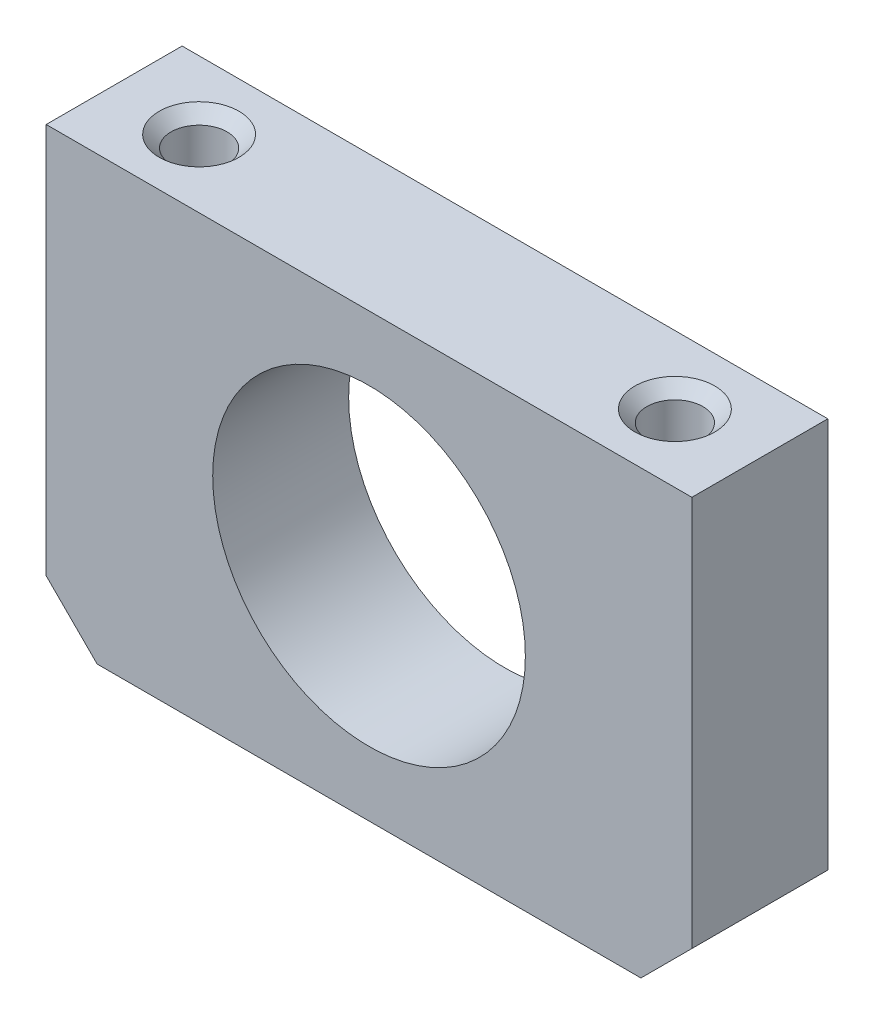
ISO-10303-21;
HEADER;
FILE_DESCRIPTION(('STEP AP214'),'2;1');
FILE_NAME('part.step','',(''),(''),'','','');
FILE_SCHEMA(('AUTOMOTIVE_DESIGN { 1 0 10303 214 1 1 1 1 }'));
ENDSEC;
DATA;
#1=APPLICATION_CONTEXT('core data for automotive mechanical design processes');
#2=APPLICATION_PROTOCOL_DEFINITION('international standard','automotive_design',2000,#1);
#3=PRODUCT_CONTEXT('',#1,'mechanical');
#4=PRODUCT('Part','Part','',(#3));
#5=PRODUCT_RELATED_PRODUCT_CATEGORY('part','',(#4));
#6=PRODUCT_DEFINITION_FORMATION('','',#4);
#7=PRODUCT_DEFINITION_CONTEXT('part definition',#1,'design');
#8=PRODUCT_DEFINITION('design','',#6,#7);
#9=PRODUCT_DEFINITION_SHAPE('','',#8);
#10=(LENGTH_UNIT() NAMED_UNIT(*) SI_UNIT(.MILLI.,.METRE.));
#11=(NAMED_UNIT(*) PLANE_ANGLE_UNIT() SI_UNIT($,.RADIAN.));
#12=(NAMED_UNIT(*) SI_UNIT($,.STERADIAN.) SOLID_ANGLE_UNIT());
#13=UNCERTAINTY_MEASURE_WITH_UNIT(LENGTH_MEASURE(1.E-05),#10,'distance_accuracy_value','');
#14=(GEOMETRIC_REPRESENTATION_CONTEXT(3) GLOBAL_UNCERTAINTY_ASSIGNED_CONTEXT((#13)) GLOBAL_UNIT_ASSIGNED_CONTEXT((#10,
#11,#12)) REPRESENTATION_CONTEXT('',''));
#15=CARTESIAN_POINT('',(0.,0.,0.));
#16=DIRECTION('',(0.,0.,1.));
#17=DIRECTION('',(1.,0.,0.));
#18=AXIS2_PLACEMENT_3D('',#15,#16,#17);
#19=CARTESIAN_POINT('',(-8.88178419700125E-13,1.66533453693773E-13,7.99999999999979));
#20=DIRECTION('',(0.999999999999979,0.,0.));
#21=DIRECTION('',(0.,0.,-0.999999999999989));
#22=AXIS2_PLACEMENT_3D('',#19,#20,#21);
#23=PLANE('',#22);
#24=DIRECTION('',(0.,-1.,0.));
#25=VECTOR('',#24,1.);
#26=CARTESIAN_POINT('',(0.,0.,0.));
#27=LINE('',#26,#25);
#28=CARTESIAN_POINT('',(-3.21964677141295E-12,26.0000000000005,1.11022302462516E-13));
#29=VERTEX_POINT('',#28);
#30=CARTESIAN_POINT('',(-5.10702591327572E-12,3.00000000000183,-2.22044604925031E-13));
#31=VERTEX_POINT('',#30);
#32=EDGE_CURVE('E120',#29,#31,#27,.T.);
#33=ORIENTED_EDGE('',*,*,#32,.T.);
#34=DIRECTION('',(0.,0.,0.999999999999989));
#35=VECTOR('',#34,1.);
#36=CARTESIAN_POINT('',(-8.10462807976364E-12,3.00000000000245,7.99999999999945));
#37=LINE('',#36,#35);
#38=CARTESIAN_POINT('',(-8.10462807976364E-12,3.00000000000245,7.99999999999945));
#39=VERTEX_POINT('',#38);
#40=EDGE_CURVE('E55',#31,#39,#37,.T.);
#41=ORIENTED_EDGE('',*,*,#40,.T.);
#42=DIRECTION('',(0.,-1.,0.));
#43=VECTOR('',#42,1.);
#44=CARTESIAN_POINT('',(-8.88178419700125E-13,1.66533453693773E-13,7.99999999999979));
#45=LINE('',#44,#43);
#46=CARTESIAN_POINT('',(-3.33066907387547E-12,26.0000000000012,8.00000000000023));
#47=VERTEX_POINT('',#46);
#48=EDGE_CURVE('E123',#47,#39,#45,.T.);
#49=ORIENTED_EDGE('',*,*,#48,.F.);
#50=DIRECTION('',(0.,0.,-0.999999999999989));
#51=VECTOR('',#50,1.);
#52=CARTESIAN_POINT('',(-3.33066907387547E-12,26.0000000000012,8.00000000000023));
#53=LINE('',#52,#51);
#54=EDGE_CURVE('E132',#47,#29,#53,.T.);
#55=ORIENTED_EDGE('',*,*,#54,.T.);
#56=EDGE_LOOP('',(#33,#41,#49,#55));
#57=FACE_BOUND('',#56,.T.);
#58=ADVANCED_FACE('F40',(#57),#23,.F.);
#59=CARTESIAN_POINT('',(-8.88178419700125E-13,1.66533453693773E-13,7.99999999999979));
#60=DIRECTION('',(0.,1.,0.));
#61=DIRECTION('',(0.,0.,0.999999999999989));
#62=AXIS2_PLACEMENT_3D('',#59,#60,#61);
#63=PLANE('',#62);
#64=DIRECTION('',(0.999999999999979,0.,0.));
#65=VECTOR('',#64,1.);
#66=CARTESIAN_POINT('',(0.,0.,0.));
#67=LINE('',#66,#65);
#68=CARTESIAN_POINT('',(2.99999999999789,2.22044604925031E-12,3.33066907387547E-13));
#69=VERTEX_POINT('',#68);
#70=CARTESIAN_POINT('',(34.9999999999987,1.11022302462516E-12,1.11022302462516E-13));
#71=VERTEX_POINT('',#70);
#72=EDGE_CURVE('E134',#69,#71,#67,.T.);
#73=ORIENTED_EDGE('',*,*,#72,.T.);
#74=DIRECTION('',(0.,0.,0.999999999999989));
#75=VECTOR('',#74,1.);
#76=CARTESIAN_POINT('',(34.9999999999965,2.83106871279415E-12,7.99999999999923));
#77=LINE('',#76,#75);
#78=CARTESIAN_POINT('',(34.9999999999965,2.83106871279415E-12,7.99999999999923));
#79=VERTEX_POINT('',#78);
#80=EDGE_CURVE('E63',#71,#79,#77,.T.);
#81=ORIENTED_EDGE('',*,*,#80,.T.);
#82=DIRECTION('',(0.999999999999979,0.,0.));
#83=VECTOR('',#82,1.);
#84=CARTESIAN_POINT('',(-8.88178419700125E-13,1.66533453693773E-13,7.99999999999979));
#85=LINE('',#84,#83);
#86=CARTESIAN_POINT('',(2.99999999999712,1.11022302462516E-12,7.99999999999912));
#87=VERTEX_POINT('',#86);
#88=EDGE_CURVE('E125',#87,#79,#85,.T.);
#89=ORIENTED_EDGE('',*,*,#88,.F.);
#90=DIRECTION('',(0.,0.,-0.999999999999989));
#91=VECTOR('',#90,1.);
#92=CARTESIAN_POINT('',(2.99999999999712,1.11022302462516E-12,7.99999999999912));
#93=LINE('',#92,#91);
#94=EDGE_CURVE('E151',#87,#69,#93,.T.);
#95=ORIENTED_EDGE('',*,*,#94,.T.);
#96=EDGE_LOOP('',(#73,#81,#89,#95));
#97=FACE_BOUND('',#96,.T.);
#98=ADVANCED_FACE('F181',(#97),#63,.F.);
#99=CARTESIAN_POINT('',(37.9999999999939,1.49880108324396E-12,8.00000000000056));
#100=DIRECTION('',(-0.999999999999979,0.,0.));
#101=DIRECTION('',(0.,0.,0.999999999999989));
#102=AXIS2_PLACEMENT_3D('',#99,#100,#101);
#103=PLANE('',#102);
#104=DIRECTION('',(0.,1.,0.));
#105=VECTOR('',#104,1.);
#106=CARTESIAN_POINT('',(37.9999999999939,1.49880108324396E-12,8.00000000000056));
#107=LINE('',#106,#105);
#108=CARTESIAN_POINT('',(37.9999999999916,3.00000000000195,7.9999999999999));
#109=VERTEX_POINT('',#108);
#110=CARTESIAN_POINT('',(37.9999999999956,26.000000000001,7.99999999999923));
#111=VERTEX_POINT('',#110);
#112=EDGE_CURVE('E128',#109,#111,#107,.T.);
#113=ORIENTED_EDGE('',*,*,#112,.F.);
#114=DIRECTION('',(0.,0.,-0.999999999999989));
#115=VECTOR('',#114,1.);
#116=CARTESIAN_POINT('',(37.9999999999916,3.00000000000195,7.9999999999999));
#117=LINE('',#116,#115);
#118=CARTESIAN_POINT('',(37.9999999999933,3.00000000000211,-3.33066907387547E-13));
#119=VERTEX_POINT('',#118);
#120=EDGE_CURVE('E144',#109,#119,#117,.T.);
#121=ORIENTED_EDGE('',*,*,#120,.T.);
#122=DIRECTION('',(0.,1.,0.));
#123=VECTOR('',#122,1.);
#124=CARTESIAN_POINT('',(37.9999999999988,8.88178419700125E-13,-3.33066907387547E-13));
#125=LINE('',#124,#123);
#126=CARTESIAN_POINT('',(37.9999999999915,26.0000000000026,-1.11022302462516E-13));
#127=VERTEX_POINT('',#126);
#128=EDGE_CURVE('E136',#119,#127,#125,.T.);
#129=ORIENTED_EDGE('',*,*,#128,.T.);
#130=DIRECTION('',(0.,0.,-0.999999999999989));
#131=VECTOR('',#130,1.);
#132=CARTESIAN_POINT('',(37.9999999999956,26.000000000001,7.99999999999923));
#133=LINE('',#132,#131);
#134=EDGE_CURVE('E141',#111,#127,#133,.T.);
#135=ORIENTED_EDGE('',*,*,#134,.F.);
#136=EDGE_LOOP('',(#113,#121,#129,#135));
#137=FACE_BOUND('',#136,.T.);
#138=ADVANCED_FACE('F186',(#137),#103,.F.);
#139=CARTESIAN_POINT('',(-3.33066907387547E-12,26.0000000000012,8.00000000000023));
#140=DIRECTION('',(0.,-1.,0.));
#141=DIRECTION('',(0.,0.,-0.999999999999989));
#142=AXIS2_PLACEMENT_3D('',#139,#140,#141);
#143=PLANE('',#142);
#144=CARTESIAN_POINT('',(32.999999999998,26.0000000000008,3.99999999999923));
#145=DIRECTION('',(0.,-1.,0.));
#146=DIRECTION('',(0.,0.,-0.999999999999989));
#147=AXIS2_PLACEMENT_3D('',#144,#145,#146);
#148=CIRCLE('',#147,2.35);
#149=CARTESIAN_POINT('',(32.9999999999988,26.0000000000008,6.35000000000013));
#150=VERTEX_POINT('',#149);
#151=EDGE_CURVE('E48',#150,#150,#148,.T.);
#152=ORIENTED_EDGE('',*,*,#151,.T.);
#153=EDGE_LOOP('',(#152));
#154=FACE_BOUND('',#153,.T.);
#155=CARTESIAN_POINT('',(4.99999999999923,26.0000000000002,4.00000000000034));
#156=DIRECTION('',(0.,-1.,0.));
#157=DIRECTION('',(0.,0.,-0.999999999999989));
#158=AXIS2_PLACEMENT_3D('',#155,#156,#157);
#159=CIRCLE('',#158,2.35);
#160=CARTESIAN_POINT('',(4.99999999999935,26.0000000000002,6.35000000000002));
#161=VERTEX_POINT('',#160);
#162=EDGE_CURVE('E163',#161,#161,#159,.T.);
#163=ORIENTED_EDGE('',*,*,#162,.T.);
#164=EDGE_LOOP('',(#163));
#165=FACE_BOUND('',#164,.T.);
#166=DIRECTION('',(-0.999999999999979,0.,0.));
#167=VECTOR('',#166,1.);
#168=CARTESIAN_POINT('',(-3.21964677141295E-12,26.0000000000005,1.11022302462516E-13));
#169=LINE('',#168,#167);
#170=EDGE_CURVE('E126',#127,#29,#169,.T.);
#171=ORIENTED_EDGE('',*,*,#170,.T.);
#172=ORIENTED_EDGE('',*,*,#54,.F.);
#173=DIRECTION('',(-0.999999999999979,0.,0.));
#174=VECTOR('',#173,1.);
#175=CARTESIAN_POINT('',(-3.33066907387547E-12,26.0000000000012,8.00000000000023));
#176=LINE('',#175,#174);
#177=EDGE_CURVE('E130',#111,#47,#176,.T.);
#178=ORIENTED_EDGE('',*,*,#177,.F.);
#179=ORIENTED_EDGE('',*,*,#134,.T.);
#180=EDGE_LOOP('',(#171,#172,#178,#179));
#181=FACE_BOUND('',#180,.T.);
#182=ADVANCED_FACE('F168',(#154,#165,#181),#143,.F.);
#183=CARTESIAN_POINT('',(-8.88178419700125E-13,1.66533453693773E-13,7.99999999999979));
#184=DIRECTION('',(0.,0.,-0.999999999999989));
#185=DIRECTION('',(-0.999999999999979,0.,0.));
#186=AXIS2_PLACEMENT_3D('',#183,#184,#185);
#187=PLANE('',#186);
#188=CARTESIAN_POINT('',(18.9999999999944,13.0000000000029,8.00000000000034));
#189=DIRECTION('',(0.,0.,-0.999999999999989));
#190=DIRECTION('',(-0.999999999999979,0.,0.));
#191=AXIS2_PLACEMENT_3D('',#188,#189,#190);
#192=CIRCLE('',#191,9.2);
#193=CARTESIAN_POINT('',(9.79999999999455,13.0000000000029,8.00000000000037));
#194=VERTEX_POINT('',#193);
#195=EDGE_CURVE('E117',#194,#194,#192,.T.);
#196=ORIENTED_EDGE('',*,*,#195,.T.);
#197=EDGE_LOOP('',(#196));
#198=FACE_BOUND('',#197,.T.);
#199=ORIENTED_EDGE('',*,*,#88,.T.);
#200=DIRECTION('',(-0.707106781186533,-0.707106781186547,0.));
#201=VECTOR('',#200,1.);
#202=CARTESIAN_POINT('',(37.9999999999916,3.00000000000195,7.9999999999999));
#203=LINE('',#202,#201);
#204=EDGE_CURVE('E157',#79,#109,#203,.F.);
#205=ORIENTED_EDGE('',*,*,#204,.T.);
#206=ORIENTED_EDGE('',*,*,#112,.T.);
#207=ORIENTED_EDGE('',*,*,#177,.T.);
#208=ORIENTED_EDGE('',*,*,#48,.T.);
#209=DIRECTION('',(-0.707106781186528,0.707106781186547,0.));
#210=VECTOR('',#209,1.);
#211=CARTESIAN_POINT('',(2.99999999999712,1.11022302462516E-12,7.99999999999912));
#212=LINE('',#211,#210);
#213=EDGE_CURVE('E155',#39,#87,#212,.F.);
#214=ORIENTED_EDGE('',*,*,#213,.T.);
#215=EDGE_LOOP('',(#199,#205,#206,#207,#208,#214));
#216=FACE_BOUND('',#215,.T.);
#217=ADVANCED_FACE('F207',(#198,#216),#187,.F.);
#218=CARTESIAN_POINT('',(0.,0.,0.));
#219=DIRECTION('',(0.,0.,-0.999999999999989));
#220=DIRECTION('',(-0.999999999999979,0.,0.));
#221=AXIS2_PLACEMENT_3D('',#218,#219,#220);
#222=PLANE('',#221);
#223=CARTESIAN_POINT('',(18.9999999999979,13.0000000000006,-5.55111512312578E-13));
#224=DIRECTION('',(0.,0.,-0.999999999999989));
#225=DIRECTION('',(-0.999999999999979,0.,0.));
#226=AXIS2_PLACEMENT_3D('',#223,#224,#225);
#227=CIRCLE('',#226,9.2);
#228=CARTESIAN_POINT('',(9.79999999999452,13.0000000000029,-5.22151766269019E-13));
#229=VERTEX_POINT('',#228);
#230=EDGE_CURVE('E114',#229,#229,#227,.T.);
#231=ORIENTED_EDGE('',*,*,#230,.F.);
#232=EDGE_LOOP('',(#231));
#233=FACE_BOUND('',#232,.T.);
#234=ORIENTED_EDGE('',*,*,#128,.F.);
#235=DIRECTION('',(0.707106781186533,0.707106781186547,0.));
#236=VECTOR('',#235,1.);
#237=CARTESIAN_POINT('',(17.4999999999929,-17.4999999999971,-3.33066907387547E-13));
#238=LINE('',#237,#236);
#239=EDGE_CURVE('E149',#119,#71,#238,.F.);
#240=ORIENTED_EDGE('',*,*,#239,.T.);
#241=ORIENTED_EDGE('',*,*,#72,.F.);
#242=DIRECTION('',(0.707106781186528,-0.707106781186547,0.));
#243=VECTOR('',#242,1.);
#244=CARTESIAN_POINT('',(1.49999999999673,1.500000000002,-2.22044604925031E-13));
#245=LINE('',#244,#243);
#246=EDGE_CURVE('E147',#69,#31,#245,.F.);
#247=ORIENTED_EDGE('',*,*,#246,.T.);
#248=ORIENTED_EDGE('',*,*,#32,.F.);
#249=ORIENTED_EDGE('',*,*,#170,.F.);
#250=EDGE_LOOP('',(#234,#240,#241,#247,#248,#249));
#251=FACE_BOUND('',#250,.T.);
#252=ADVANCED_FACE('F212',(#233,#251),#222,.T.);
#253=CARTESIAN_POINT('',(18.9999999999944,13.0000000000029,8.00000000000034));
#254=DIRECTION('',(0.,0.,-0.999999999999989));
#255=DIRECTION('',(-0.999999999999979,0.,0.));
#256=AXIS2_PLACEMENT_3D('',#253,#254,#255);
#257=CYLINDRICAL_SURFACE('',#256,9.2);
#258=CARTESIAN_POINT('',(9.79999999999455,13.0000000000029,8.00000000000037));
#259=CARTESIAN_POINT('',(9.79999999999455,13.0000000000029,7.91666666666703));
#260=CARTESIAN_POINT('',(9.79999999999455,13.0000000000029,7.83333333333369));
#261=CARTESIAN_POINT('',(9.79999999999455,13.0000000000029,7.666666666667));
#262=CARTESIAN_POINT('',(9.79999999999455,13.0000000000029,7.58333333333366));
#263=CARTESIAN_POINT('',(9.79999999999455,13.0000000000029,7.41666666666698));
#264=CARTESIAN_POINT('',(9.79999999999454,13.0000000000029,7.33333333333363));
#265=CARTESIAN_POINT('',(9.79999999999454,13.0000000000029,7.16666666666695));
#266=CARTESIAN_POINT('',(9.79999999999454,13.0000000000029,7.0833333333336));
#267=CARTESIAN_POINT('',(9.79999999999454,13.0000000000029,6.91666666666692));
#268=CARTESIAN_POINT('',(9.79999999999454,13.0000000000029,6.83333333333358));
#269=CARTESIAN_POINT('',(9.79999999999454,13.0000000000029,6.66666666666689));
#270=CARTESIAN_POINT('',(9.79999999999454,13.0000000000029,6.58333333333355));
#271=CARTESIAN_POINT('',(9.79999999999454,13.0000000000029,6.41666666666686));
#272=CARTESIAN_POINT('',(9.79999999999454,13.0000000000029,6.33333333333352));
#273=CARTESIAN_POINT('',(9.79999999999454,13.0000000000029,6.16666666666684));
#274=CARTESIAN_POINT('',(9.79999999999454,13.0000000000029,6.08333333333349));
#275=CARTESIAN_POINT('',(9.79999999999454,13.0000000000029,5.91666666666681));
#276=CARTESIAN_POINT('',(9.79999999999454,13.0000000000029,5.83333333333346));
#277=CARTESIAN_POINT('',(9.79999999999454,13.0000000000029,5.66666666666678));
#278=CARTESIAN_POINT('',(9.79999999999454,13.0000000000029,5.58333333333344));
#279=CARTESIAN_POINT('',(9.79999999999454,13.0000000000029,5.41666666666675));
#280=CARTESIAN_POINT('',(9.79999999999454,13.0000000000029,5.33333333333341));
#281=CARTESIAN_POINT('',(9.79999999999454,13.0000000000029,5.16666666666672));
#282=CARTESIAN_POINT('',(9.79999999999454,13.0000000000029,5.08333333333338));
#283=CARTESIAN_POINT('',(9.79999999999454,13.0000000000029,4.9166666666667));
#284=CARTESIAN_POINT('',(9.79999999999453,13.0000000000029,4.83333333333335));
#285=CARTESIAN_POINT('',(9.79999999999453,13.0000000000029,4.66666666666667));
#286=CARTESIAN_POINT('',(9.79999999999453,13.0000000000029,4.58333333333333));
#287=CARTESIAN_POINT('',(9.79999999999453,13.0000000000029,4.41666666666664));
#288=CARTESIAN_POINT('',(9.79999999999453,13.0000000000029,4.3333333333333));
#289=CARTESIAN_POINT('',(9.79999999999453,13.0000000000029,4.16666666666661));
#290=CARTESIAN_POINT('',(9.79999999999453,13.0000000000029,4.08333333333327));
#291=CARTESIAN_POINT('',(9.79999999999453,13.0000000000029,3.91666666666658));
#292=CARTESIAN_POINT('',(9.79999999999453,13.0000000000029,3.83333333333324));
#293=CARTESIAN_POINT('',(9.79999999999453,13.0000000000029,3.66666666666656));
#294=CARTESIAN_POINT('',(9.79999999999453,13.0000000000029,3.58333333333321));
#295=CARTESIAN_POINT('',(9.79999999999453,13.0000000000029,3.41666666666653));
#296=CARTESIAN_POINT('',(9.79999999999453,13.0000000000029,3.33333333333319));
#297=CARTESIAN_POINT('',(9.79999999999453,13.0000000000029,3.1666666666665));
#298=CARTESIAN_POINT('',(9.79999999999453,13.0000000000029,3.08333333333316));
#299=CARTESIAN_POINT('',(9.79999999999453,13.0000000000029,2.91666666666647));
#300=CARTESIAN_POINT('',(9.79999999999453,13.0000000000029,2.83333333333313));
#301=CARTESIAN_POINT('',(9.79999999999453,13.0000000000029,2.66666666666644));
#302=CARTESIAN_POINT('',(9.79999999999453,13.0000000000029,2.5833333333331));
#303=CARTESIAN_POINT('',(9.79999999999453,13.0000000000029,2.41666666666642));
#304=CARTESIAN_POINT('',(9.79999999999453,13.0000000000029,2.33333333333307));
#305=CARTESIAN_POINT('',(9.79999999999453,13.0000000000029,2.16666666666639));
#306=CARTESIAN_POINT('',(9.79999999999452,13.0000000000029,2.08333333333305));
#307=CARTESIAN_POINT('',(9.79999999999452,13.0000000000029,1.91666666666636));
#308=CARTESIAN_POINT('',(9.79999999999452,13.0000000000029,1.83333333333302));
#309=CARTESIAN_POINT('',(9.79999999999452,13.0000000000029,1.66666666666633));
#310=CARTESIAN_POINT('',(9.79999999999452,13.0000000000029,1.58333333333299));
#311=CARTESIAN_POINT('',(9.79999999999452,13.0000000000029,1.4166666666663));
#312=CARTESIAN_POINT('',(9.79999999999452,13.0000000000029,1.33333333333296));
#313=CARTESIAN_POINT('',(9.79999999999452,13.0000000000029,1.16666666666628));
#314=CARTESIAN_POINT('',(9.79999999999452,13.0000000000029,1.08333333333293));
#315=CARTESIAN_POINT('',(9.79999999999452,13.0000000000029,0.916666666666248));
#316=CARTESIAN_POINT('',(9.79999999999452,13.0000000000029,0.833333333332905));
#317=CARTESIAN_POINT('',(9.79999999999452,13.0000000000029,0.66666666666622));
#318=CARTESIAN_POINT('',(9.79999999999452,13.0000000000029,0.583333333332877));
#319=CARTESIAN_POINT('',(9.79999999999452,13.0000000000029,0.416666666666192));
#320=CARTESIAN_POINT('',(9.79999999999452,13.0000000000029,0.333333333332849));
#321=CARTESIAN_POINT('',(9.79999999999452,13.0000000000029,0.166666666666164));
#322=CARTESIAN_POINT('',(9.79999999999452,13.0000000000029,0.0833333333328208));
#323=CARTESIAN_POINT('',(9.79999999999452,13.0000000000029,-5.22151766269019E-13));
#324=B_SPLINE_CURVE_WITH_KNOTS('',3,(#258,#259,#260,#261,#262,#263,#264,#265,#266,#267,#268,
#269,#270,#271,#272,#273,#274,#275,#276,#277,#278,#279,#280,#281,#282,#283,#284,#285,#286,#287,
#288,#289,#290,#291,#292,#293,#294,#295,#296,#297,#298,#299,#300,#301,#302,#303,#304,#305,#306,
#307,#308,#309,#310,#311,#312,#313,#314,#315,#316,#317,#318,#319,#320,#321,#322,#323),
.UNSPECIFIED.,.F.,.F.,(4,2,2,2,2,2,2,2,2,2,2,2,2,2,2,2,2,2,2,2,2,2,2,2,2,2,2,2,2,2,2,2,4),(0.,
0.250000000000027,0.500000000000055,0.750000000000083,1.00000000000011,1.25000000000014,
1.50000000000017,1.75000000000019,2.00000000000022,2.25000000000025,2.50000000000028,
2.75000000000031,3.00000000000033,3.25000000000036,3.50000000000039,3.75000000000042,
4.00000000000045,4.25000000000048,4.5000000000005,4.75000000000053,5.00000000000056,
5.25000000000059,5.50000000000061,5.75000000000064,6.00000000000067,6.2500000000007,
6.50000000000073,6.75000000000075,7.00000000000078,7.25000000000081,7.50000000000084,
7.75000000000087,8.0000000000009),.UNSPECIFIED.);
#325=EDGE_CURVE('BSEAM194',#194,#229,#324,.T.);
#326=ORIENTED_EDGE('',*,*,#195,.F.);
#327=ORIENTED_EDGE('',*,*,#230,.T.);
#328=ORIENTED_EDGE('',*,*,#325,.T.);
#329=ORIENTED_EDGE('',*,*,#325,.F.);
#330=EDGE_LOOP('',(#326,#328,#327,#329));
#331=FACE_BOUND('',#330,.T.);
#332=ADVANCED_FACE('F194',(#331),#257,.F.);
#333=CARTESIAN_POINT('',(37.9999999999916,3.00000000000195,7.9999999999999));
#334=DIRECTION('',(-0.707106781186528,0.707106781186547,0.));
#335=DIRECTION('',(0.,0.,-0.999999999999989));
#336=AXIS2_PLACEMENT_3D('',#333,#334,#335);
#337=PLANE('',#336);
#338=ORIENTED_EDGE('',*,*,#204,.F.);
#339=ORIENTED_EDGE('',*,*,#80,.F.);
#340=ORIENTED_EDGE('',*,*,#239,.F.);
#341=ORIENTED_EDGE('',*,*,#120,.F.);
#342=EDGE_LOOP('',(#338,#339,#340,#341));
#343=FACE_BOUND('',#342,.T.);
#344=ADVANCED_FACE('F190',(#343),#337,.F.);
#345=CARTESIAN_POINT('',(2.99999999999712,1.11022302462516E-12,7.99999999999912));
#346=DIRECTION('',(0.707106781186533,0.707106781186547,0.));
#347=DIRECTION('',(0.,0.,-0.999999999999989));
#348=AXIS2_PLACEMENT_3D('',#345,#346,#347);
#349=PLANE('',#348);
#350=ORIENTED_EDGE('',*,*,#213,.F.);
#351=ORIENTED_EDGE('',*,*,#40,.F.);
#352=ORIENTED_EDGE('',*,*,#246,.F.);
#353=ORIENTED_EDGE('',*,*,#94,.F.);
#354=EDGE_LOOP('',(#350,#351,#352,#353));
#355=FACE_BOUND('',#354,.T.);
#356=ADVANCED_FACE('F193',(#355),#349,.F.);
#357=CARTESIAN_POINT('',(4.99999999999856,11.0000000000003,4.00000000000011));
#358=DIRECTION('',(0.,1.,0.));
#359=DIRECTION('',(0.,0.,0.999999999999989));
#360=AXIS2_PLACEMENT_3D('',#357,#358,#359);
#361=CONICAL_SURFACE('',#360,1.65,1.02974425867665);
#362=CARTESIAN_POINT('',(4.99999999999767,10.0085799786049,3.99999999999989));
#363=VERTEX_POINT('',#362);
#364=VERTEX_LOOP('',#363);
#365=FACE_BOUND('',#364,.T.);
#366=CARTESIAN_POINT('',(4.99999999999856,11.0000000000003,4.00000000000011));
#367=DIRECTION('',(0.,1.,0.));
#368=DIRECTION('',(0.,0.,0.999999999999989));
#369=AXIS2_PLACEMENT_3D('',#366,#367,#368);
#370=CIRCLE('',#369,1.65);
#371=CARTESIAN_POINT('',(4.99999999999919,11.0000000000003,5.65000000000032));
#372=VERTEX_POINT('',#371);
#373=EDGE_CURVE('E111',#372,#372,#370,.T.);
#374=ORIENTED_EDGE('',*,*,#373,.T.);
#375=EDGE_LOOP('',(#374));
#376=FACE_BOUND('',#375,.T.);
#377=ADVANCED_FACE('F197',(#365,#376),#361,.F.);
#378=CARTESIAN_POINT('',(4.99999999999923,26.0000000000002,4.00000000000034));
#379=DIRECTION('',(0.,1.,0.));
#380=DIRECTION('',(0.,0.,0.999999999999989));
#381=AXIS2_PLACEMENT_3D('',#378,#379,#380);
#382=CYLINDRICAL_SURFACE('',#381,1.64999999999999);
#383=CARTESIAN_POINT('',(4.99999999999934,25.3000000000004,4.00000000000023));
#384=DIRECTION('',(0.,-1.,0.));
#385=DIRECTION('',(0.,0.,-0.999999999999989));
#386=AXIS2_PLACEMENT_3D('',#383,#384,#385);
#387=CIRCLE('',#386,1.64999999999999);
#388=CARTESIAN_POINT('',(4.99999999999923,25.3000000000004,5.65000000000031));
#389=VERTEX_POINT('',#388);
#390=EDGE_CURVE('E11',#389,#389,#387,.F.);
#391=CARTESIAN_POINT('',(4.99999999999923,25.3000000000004,5.65000000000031));
#392=CARTESIAN_POINT('',(4.99999999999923,25.1510416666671,5.65000000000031));
#393=CARTESIAN_POINT('',(4.99999999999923,25.0020833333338,5.65000000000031));
#394=CARTESIAN_POINT('',(4.99999999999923,24.7041666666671,5.65000000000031));
#395=CARTESIAN_POINT('',(4.99999999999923,24.5552083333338,5.65000000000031));
#396=CARTESIAN_POINT('',(4.99999999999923,24.2572916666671,5.65000000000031));
#397=CARTESIAN_POINT('',(4.99999999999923,24.1083333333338,5.65000000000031));
#398=CARTESIAN_POINT('',(4.99999999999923,23.8104166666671,5.65000000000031));
#399=CARTESIAN_POINT('',(4.99999999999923,23.6614583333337,5.65000000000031));
#400=CARTESIAN_POINT('',(4.99999999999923,23.3635416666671,5.65000000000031));
#401=CARTESIAN_POINT('',(4.99999999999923,23.2145833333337,5.65000000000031));
#402=CARTESIAN_POINT('',(4.99999999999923,22.9166666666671,5.65000000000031));
#403=CARTESIAN_POINT('',(4.99999999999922,22.7677083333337,5.65000000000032));
#404=CARTESIAN_POINT('',(4.99999999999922,22.4697916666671,5.65000000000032));
#405=CARTESIAN_POINT('',(4.99999999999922,22.3208333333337,5.65000000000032));
#406=CARTESIAN_POINT('',(4.99999999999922,22.0229166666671,5.65000000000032));
#407=CARTESIAN_POINT('',(4.99999999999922,21.8739583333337,5.65000000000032));
#408=CARTESIAN_POINT('',(4.99999999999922,21.5760416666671,5.65000000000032));
#409=CARTESIAN_POINT('',(4.99999999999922,21.4270833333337,5.65000000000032));
#410=CARTESIAN_POINT('',(4.99999999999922,21.1291666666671,5.65000000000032));
#411=CARTESIAN_POINT('',(4.99999999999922,20.9802083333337,5.65000000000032));
#412=CARTESIAN_POINT('',(4.99999999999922,20.6822916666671,5.65000000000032));
#413=CARTESIAN_POINT('',(4.99999999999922,20.5333333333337,5.65000000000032));
#414=CARTESIAN_POINT('',(4.99999999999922,20.235416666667,5.65000000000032));
#415=CARTESIAN_POINT('',(4.99999999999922,20.0864583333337,5.65000000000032));
#416=CARTESIAN_POINT('',(4.99999999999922,19.788541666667,5.65000000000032));
#417=CARTESIAN_POINT('',(4.99999999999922,19.6395833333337,5.65000000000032));
#418=CARTESIAN_POINT('',(4.99999999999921,19.341666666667,5.65000000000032));
#419=CARTESIAN_POINT('',(4.99999999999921,19.1927083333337,5.65000000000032));
#420=CARTESIAN_POINT('',(4.99999999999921,18.894791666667,5.65000000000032));
#421=CARTESIAN_POINT('',(4.99999999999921,18.7458333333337,5.65000000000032));
#422=CARTESIAN_POINT('',(4.99999999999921,18.447916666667,5.65000000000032));
#423=CARTESIAN_POINT('',(4.99999999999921,18.2989583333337,5.65000000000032));
#424=CARTESIAN_POINT('',(4.99999999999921,18.001041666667,5.65000000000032));
#425=CARTESIAN_POINT('',(4.99999999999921,17.8520833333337,5.65000000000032));
#426=CARTESIAN_POINT('',(4.99999999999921,17.554166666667,5.65000000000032));
#427=CARTESIAN_POINT('',(4.99999999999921,17.4052083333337,5.65000000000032));
#428=CARTESIAN_POINT('',(4.99999999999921,17.107291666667,5.65000000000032));
#429=CARTESIAN_POINT('',(4.99999999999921,16.9583333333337,5.65000000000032));
#430=CARTESIAN_POINT('',(4.99999999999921,16.660416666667,5.65000000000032));
#431=CARTESIAN_POINT('',(4.99999999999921,16.5114583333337,5.65000000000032));
#432=CARTESIAN_POINT('',(4.99999999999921,16.213541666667,5.65000000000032));
#433=CARTESIAN_POINT('',(4.99999999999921,16.0645833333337,5.65000000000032));
#434=CARTESIAN_POINT('',(4.99999999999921,15.766666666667,5.65000000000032));
#435=CARTESIAN_POINT('',(4.99999999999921,15.6177083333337,5.65000000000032));
#436=CARTESIAN_POINT('',(4.99999999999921,15.319791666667,5.65000000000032));
#437=CARTESIAN_POINT('',(4.99999999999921,15.1708333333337,5.65000000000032));
#438=CARTESIAN_POINT('',(4.9999999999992,14.872916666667,5.65000000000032));
#439=CARTESIAN_POINT('',(4.9999999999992,14.7239583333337,5.65000000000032));
#440=CARTESIAN_POINT('',(4.9999999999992,14.426041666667,5.65000000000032));
#441=CARTESIAN_POINT('',(4.9999999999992,14.2770833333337,5.65000000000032));
#442=CARTESIAN_POINT('',(4.9999999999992,13.979166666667,5.65000000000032));
#443=CARTESIAN_POINT('',(4.9999999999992,13.8302083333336,5.65000000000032));
#444=CARTESIAN_POINT('',(4.9999999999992,13.532291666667,5.65000000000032));
#445=CARTESIAN_POINT('',(4.9999999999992,13.3833333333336,5.65000000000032));
#446=CARTESIAN_POINT('',(4.9999999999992,13.085416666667,5.65000000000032));
#447=CARTESIAN_POINT('',(4.9999999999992,12.9364583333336,5.65000000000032));
#448=CARTESIAN_POINT('',(4.9999999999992,12.638541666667,5.65000000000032));
#449=CARTESIAN_POINT('',(4.9999999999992,12.4895833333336,5.65000000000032));
#450=CARTESIAN_POINT('',(4.9999999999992,12.191666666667,5.65000000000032));
#451=CARTESIAN_POINT('',(4.9999999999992,12.0427083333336,5.65000000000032));
#452=CARTESIAN_POINT('',(4.9999999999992,11.744791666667,5.65000000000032));
#453=CARTESIAN_POINT('',(4.99999999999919,11.5958333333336,5.65000000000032));
#454=CARTESIAN_POINT('',(4.99999999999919,11.297916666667,5.65000000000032));
#455=CARTESIAN_POINT('',(4.99999999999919,11.1489583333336,5.65000000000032));
#456=CARTESIAN_POINT('',(4.99999999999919,11.0000000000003,5.65000000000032));
#457=B_SPLINE_CURVE_WITH_KNOTS('',3,(#391,#392,#393,#394,#395,#396,#397,#398,#399,#400,#401,
#402,#403,#404,#405,#406,#407,#408,#409,#410,#411,#412,#413,#414,#415,#416,#417,#418,#419,#420,
#421,#422,#423,#424,#425,#426,#427,#428,#429,#430,#431,#432,#433,#434,#435,#436,#437,#438,#439,
#440,#441,#442,#443,#444,#445,#446,#447,#448,#449,#450,#451,#452,#453,#454,#455,#456),
.UNSPECIFIED.,.F.,.F.,(4,2,2,2,2,2,2,2,2,2,2,2,2,2,2,2,2,2,2,2,2,2,2,2,2,2,2,2,2,2,2,2,4),(0.,
0.446875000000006,0.893750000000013,1.34062500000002,1.78750000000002,2.23437500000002,
2.68125000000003,3.12812500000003,3.57500000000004,4.02187500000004,4.46875000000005,
4.91562500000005,5.36250000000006,5.80937500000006,6.25625000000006,6.70312500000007,
7.15000000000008,7.59687500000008,8.04375000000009,8.49062500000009,8.93750000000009,
9.3843750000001,9.8312500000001,10.2781250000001,10.7250000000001,11.1718750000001,
11.6187500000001,12.0656250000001,12.5125000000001,12.9593750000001,13.4062500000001,
13.8531250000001,14.3000000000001),.UNSPECIFIED.);
#458=EDGE_CURVE('BSEAM105',#389,#372,#457,.T.);
#459=ORIENTED_EDGE('',*,*,#390,.T.);
#460=ORIENTED_EDGE('',*,*,#373,.F.);
#461=ORIENTED_EDGE('',*,*,#458,.T.);
#462=ORIENTED_EDGE('',*,*,#458,.F.);
#463=EDGE_LOOP('',(#459,#461,#460,#462));
#464=FACE_BOUND('',#463,.T.);
#465=ADVANCED_FACE('F105',(#464),#382,.F.);
#466=CARTESIAN_POINT('',(32.9999999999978,11.0000000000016,4.00000000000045));
#467=DIRECTION('',(0.,1.,0.));
#468=DIRECTION('',(0.,0.,0.999999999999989));
#469=AXIS2_PLACEMENT_3D('',#466,#467,#468);
#470=CONICAL_SURFACE('',#469,1.65,1.02974425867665);
#471=CARTESIAN_POINT('',(32.9999999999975,10.0085799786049,4.00000000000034));
#472=VERTEX_POINT('',#471);
#473=VERTEX_LOOP('',#472);
#474=FACE_BOUND('',#473,.T.);
#475=CARTESIAN_POINT('',(32.9999999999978,11.0000000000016,4.00000000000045));
#476=DIRECTION('',(0.,1.,0.));
#477=DIRECTION('',(0.,0.,0.999999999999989));
#478=AXIS2_PLACEMENT_3D('',#475,#476,#477);
#479=CIRCLE('',#478,1.65);
#480=CARTESIAN_POINT('',(32.999999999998,11.0000000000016,5.64999999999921));
#481=VERTEX_POINT('',#480);
#482=EDGE_CURVE('E109',#481,#481,#479,.T.);
#483=ORIENTED_EDGE('',*,*,#482,.T.);
#484=EDGE_LOOP('',(#483));
#485=FACE_BOUND('',#484,.T.);
#486=ADVANCED_FACE('F101',(#474,#485),#470,.F.);
#487=CARTESIAN_POINT('',(32.999999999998,26.0000000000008,3.99999999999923));
#488=DIRECTION('',(0.,1.,0.));
#489=DIRECTION('',(0.,0.,0.999999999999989));
#490=AXIS2_PLACEMENT_3D('',#487,#488,#489);
#491=CYLINDRICAL_SURFACE('',#490,1.65);
#492=CARTESIAN_POINT('',(32.9999999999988,25.3000000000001,3.99999999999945));
#493=DIRECTION('',(0.,-1.,0.));
#494=DIRECTION('',(0.,0.,-0.999999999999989));
#495=AXIS2_PLACEMENT_3D('',#492,#493,#494);
#496=CIRCLE('',#495,1.65);
#497=CARTESIAN_POINT('',(32.999999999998,25.3000000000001,5.64999999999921));
#498=VERTEX_POINT('',#497);
#499=EDGE_CURVE('E160',#498,#498,#496,.F.);
#500=CARTESIAN_POINT('',(32.999999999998,25.3000000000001,5.64999999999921));
#501=CARTESIAN_POINT('',(32.999999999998,25.1510416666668,5.64999999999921));
#502=CARTESIAN_POINT('',(32.999999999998,25.0020833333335,5.64999999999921));
#503=CARTESIAN_POINT('',(32.999999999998,24.7041666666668,5.64999999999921));
#504=CARTESIAN_POINT('',(32.999999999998,24.5552083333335,5.64999999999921));
#505=CARTESIAN_POINT('',(32.999999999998,24.2572916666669,5.64999999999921));
#506=CARTESIAN_POINT('',(32.999999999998,24.1083333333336,5.64999999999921));
#507=CARTESIAN_POINT('',(32.999999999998,23.8104166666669,5.64999999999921));
#508=CARTESIAN_POINT('',(32.999999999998,23.6614583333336,5.64999999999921));
#509=CARTESIAN_POINT('',(32.999999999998,23.363541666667,5.64999999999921));
#510=CARTESIAN_POINT('',(32.999999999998,23.2145833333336,5.64999999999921));
#511=CARTESIAN_POINT('',(32.999999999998,22.916666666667,5.64999999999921));
#512=CARTESIAN_POINT('',(32.999999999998,22.7677083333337,5.64999999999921));
#513=CARTESIAN_POINT('',(32.999999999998,22.4697916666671,5.64999999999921));
#514=CARTESIAN_POINT('',(32.999999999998,22.3208333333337,5.64999999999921));
#515=CARTESIAN_POINT('',(32.999999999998,22.0229166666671,5.64999999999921));
#516=CARTESIAN_POINT('',(32.999999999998,21.8739583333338,5.64999999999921));
#517=CARTESIAN_POINT('',(32.999999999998,21.5760416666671,5.64999999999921));
#518=CARTESIAN_POINT('',(32.999999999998,21.4270833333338,5.64999999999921));
#519=CARTESIAN_POINT('',(32.999999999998,21.1291666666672,5.64999999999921));
#520=CARTESIAN_POINT('',(32.999999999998,20.9802083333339,5.64999999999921));
#521=CARTESIAN_POINT('',(32.999999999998,20.6822916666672,5.64999999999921));
#522=CARTESIAN_POINT('',(32.999999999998,20.5333333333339,5.64999999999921));
#523=CARTESIAN_POINT('',(32.999999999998,20.2354166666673,5.64999999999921));
#524=CARTESIAN_POINT('',(32.999999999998,20.086458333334,5.64999999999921));
#525=CARTESIAN_POINT('',(32.999999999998,19.7885416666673,5.64999999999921));
#526=CARTESIAN_POINT('',(32.999999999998,19.639583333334,5.64999999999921));
#527=CARTESIAN_POINT('',(32.999999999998,19.3416666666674,5.64999999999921));
#528=CARTESIAN_POINT('',(32.999999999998,19.1927083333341,5.64999999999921));
#529=CARTESIAN_POINT('',(32.999999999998,18.8947916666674,5.64999999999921));
#530=CARTESIAN_POINT('',(32.999999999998,18.7458333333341,5.64999999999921));
#531=CARTESIAN_POINT('',(32.999999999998,18.4479166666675,5.64999999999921));
#532=CARTESIAN_POINT('',(32.999999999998,18.2989583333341,5.64999999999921));
#533=CARTESIAN_POINT('',(32.999999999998,18.0010416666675,5.64999999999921));
#534=CARTESIAN_POINT('',(32.999999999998,17.8520833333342,5.64999999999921));
#535=CARTESIAN_POINT('',(32.999999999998,17.5541666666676,5.64999999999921));
#536=CARTESIAN_POINT('',(32.999999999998,17.4052083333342,5.64999999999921));
#537=CARTESIAN_POINT('',(32.999999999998,17.1072916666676,5.64999999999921));
#538=CARTESIAN_POINT('',(32.999999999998,16.9583333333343,5.64999999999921));
#539=CARTESIAN_POINT('',(32.999999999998,16.6604166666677,5.64999999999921));
#540=CARTESIAN_POINT('',(32.999999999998,16.5114583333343,5.64999999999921));
#541=CARTESIAN_POINT('',(32.999999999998,16.2135416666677,5.64999999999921));
#542=CARTESIAN_POINT('',(32.999999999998,16.0645833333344,5.64999999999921));
#543=CARTESIAN_POINT('',(32.999999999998,15.7666666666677,5.64999999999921));
#544=CARTESIAN_POINT('',(32.999999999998,15.6177083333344,5.64999999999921));
#545=CARTESIAN_POINT('',(32.999999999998,15.3197916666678,5.64999999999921));
#546=CARTESIAN_POINT('',(32.999999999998,15.1708333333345,5.64999999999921));
#547=CARTESIAN_POINT('',(32.999999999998,14.8729166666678,5.64999999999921));
#548=CARTESIAN_POINT('',(32.999999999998,14.7239583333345,5.64999999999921));
#549=CARTESIAN_POINT('',(32.999999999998,14.4260416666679,5.64999999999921));
#550=CARTESIAN_POINT('',(32.999999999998,14.2770833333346,5.64999999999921));
#551=CARTESIAN_POINT('',(32.999999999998,13.9791666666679,5.64999999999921));
#552=CARTESIAN_POINT('',(32.999999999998,13.8302083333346,5.64999999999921));
#553=CARTESIAN_POINT('',(32.999999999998,13.532291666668,5.64999999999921));
#554=CARTESIAN_POINT('',(32.999999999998,13.3833333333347,5.64999999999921));
#555=CARTESIAN_POINT('',(32.999999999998,13.085416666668,5.64999999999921));
#556=CARTESIAN_POINT('',(32.999999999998,12.9364583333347,5.64999999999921));
#557=CARTESIAN_POINT('',(32.999999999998,12.6385416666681,5.64999999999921));
#558=CARTESIAN_POINT('',(32.999999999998,12.4895833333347,5.64999999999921));
#559=CARTESIAN_POINT('',(32.999999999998,12.1916666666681,5.64999999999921));
#560=CARTESIAN_POINT('',(32.999999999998,12.0427083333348,5.64999999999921));
#561=CARTESIAN_POINT('',(32.999999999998,11.7447916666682,5.64999999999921));
#562=CARTESIAN_POINT('',(32.999999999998,11.5958333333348,5.64999999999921));
#563=CARTESIAN_POINT('',(32.999999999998,11.2979166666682,5.64999999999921));
#564=CARTESIAN_POINT('',(32.999999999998,11.1489583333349,5.64999999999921));
#565=CARTESIAN_POINT('',(32.999999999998,11.0000000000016,5.64999999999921));
#566=B_SPLINE_CURVE_WITH_KNOTS('',3,(#500,#501,#502,#503,#504,#505,#506,#507,#508,#509,#510,
#511,#512,#513,#514,#515,#516,#517,#518,#519,#520,#521,#522,#523,#524,#525,#526,#527,#528,#529,
#530,#531,#532,#533,#534,#535,#536,#537,#538,#539,#540,#541,#542,#543,#544,#545,#546,#547,#548,
#549,#550,#551,#552,#553,#554,#555,#556,#557,#558,#559,#560,#561,#562,#563,#564,#565),
.UNSPECIFIED.,.F.,.F.,(4,2,2,2,2,2,2,2,2,2,2,2,2,2,2,2,2,2,2,2,2,2,2,2,2,2,2,2,2,2,2,2,4),(0.,
0.446874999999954,0.893749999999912,1.34062499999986,1.78749999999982,2.23437499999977,
2.68124999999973,3.12812499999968,3.57499999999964,4.02187499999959,4.46874999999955,
4.9156249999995,5.36249999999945,5.80937499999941,6.25624999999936,6.70312499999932,
7.14999999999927,7.59687499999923,8.04374999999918,8.49062499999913,8.93749999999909,
9.38437499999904,9.831249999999,10.278124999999,10.7249999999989,11.1718749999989,
11.6187499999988,12.0656249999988,12.5124999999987,12.9593749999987,13.4062499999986,
13.8531249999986,14.2999999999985),.UNSPECIFIED.);
#567=EDGE_CURVE('BSEAM104',#498,#481,#566,.T.);
#568=ORIENTED_EDGE('',*,*,#499,.T.);
#569=ORIENTED_EDGE('',*,*,#482,.F.);
#570=ORIENTED_EDGE('',*,*,#567,.T.);
#571=ORIENTED_EDGE('',*,*,#567,.F.);
#572=EDGE_LOOP('',(#568,#570,#569,#571));
#573=FACE_BOUND('',#572,.T.);
#574=ADVANCED_FACE('F104',(#573),#491,.F.);
#575=CARTESIAN_POINT('',(32.9999999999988,25.3000000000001,3.99999999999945));
#576=DIRECTION('',(0.,1.,0.));
#577=DIRECTION('',(0.,0.,0.999999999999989));
#578=AXIS2_PLACEMENT_3D('',#575,#576,#577);
#579=CONICAL_SURFACE('',#578,1.65,0.785398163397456);
#580=CARTESIAN_POINT('',(32.9999999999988,26.0000000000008,6.35000000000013));
#581=CARTESIAN_POINT('',(32.9999999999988,25.9927083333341,6.34270833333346));
#582=CARTESIAN_POINT('',(32.9999999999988,25.9854166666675,6.33541666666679));
#583=CARTESIAN_POINT('',(32.9999999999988,25.9708333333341,6.32083333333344));
#584=CARTESIAN_POINT('',(32.9999999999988,25.9635416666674,6.31354166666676));
#585=CARTESIAN_POINT('',(32.9999999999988,25.9489583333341,6.29895833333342));
#586=CARTESIAN_POINT('',(32.9999999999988,25.9416666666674,6.29166666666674));
#587=CARTESIAN_POINT('',(32.9999999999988,25.9270833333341,6.27708333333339));
#588=CARTESIAN_POINT('',(32.9999999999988,25.9197916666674,6.26979166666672));
#589=CARTESIAN_POINT('',(32.9999999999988,25.905208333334,6.25520833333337));
#590=CARTESIAN_POINT('',(32.9999999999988,25.8979166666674,6.2479166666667));
#591=CARTESIAN_POINT('',(32.9999999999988,25.883333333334,6.23333333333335));
#592=CARTESIAN_POINT('',(32.9999999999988,25.8760416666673,6.22604166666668));
#593=CARTESIAN_POINT('',(32.9999999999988,25.861458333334,6.21145833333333));
#594=CARTESIAN_POINT('',(32.9999999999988,25.8541666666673,6.20416666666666));
#595=CARTESIAN_POINT('',(32.9999999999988,25.839583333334,6.18958333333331));
#596=CARTESIAN_POINT('',(32.9999999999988,25.8322916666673,6.18229166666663));
#597=CARTESIAN_POINT('',(32.9999999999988,25.817708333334,6.16770833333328));
#598=CARTESIAN_POINT('',(32.9999999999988,25.8104166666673,6.16041666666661));
#599=CARTESIAN_POINT('',(32.9999999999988,25.7958333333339,6.14583333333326));
#600=CARTESIAN_POINT('',(32.9999999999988,25.7885416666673,6.13854166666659));
#601=CARTESIAN_POINT('',(32.9999999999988,25.7739583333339,6.12395833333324));
#602=CARTESIAN_POINT('',(32.9999999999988,25.7666666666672,6.11666666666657));
#603=CARTESIAN_POINT('',(32.9999999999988,25.7520833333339,6.10208333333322));
#604=CARTESIAN_POINT('',(32.9999999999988,25.7447916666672,6.09479166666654));
#605=CARTESIAN_POINT('',(32.9999999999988,25.7302083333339,6.0802083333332));
#606=CARTESIAN_POINT('',(32.9999999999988,25.7229166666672,6.07291666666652));
#607=CARTESIAN_POINT('',(32.9999999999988,25.7083333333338,6.05833333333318));
#608=CARTESIAN_POINT('',(32.9999999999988,25.7010416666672,6.0510416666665));
#609=CARTESIAN_POINT('',(32.9999999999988,25.6864583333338,6.03645833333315));
#610=CARTESIAN_POINT('',(32.9999999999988,25.6791666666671,6.02916666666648));
#611=CARTESIAN_POINT('',(32.9999999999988,25.6645833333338,6.01458333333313));
#612=CARTESIAN_POINT('',(32.9999999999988,25.6572916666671,6.00729166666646));
#613=CARTESIAN_POINT('',(32.9999999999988,25.6427083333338,5.99270833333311));
#614=CARTESIAN_POINT('',(32.9999999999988,25.6354166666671,5.98541666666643));
#615=CARTESIAN_POINT('',(32.9999999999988,25.6208333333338,5.97083333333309));
#616=CARTESIAN_POINT('',(32.9999999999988,25.6135416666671,5.96354166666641));
#617=CARTESIAN_POINT('',(32.9999999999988,25.5989583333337,5.94895833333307));
#618=CARTESIAN_POINT('',(32.9999999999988,25.5916666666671,5.94166666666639));
#619=CARTESIAN_POINT('',(32.9999999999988,25.5770833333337,5.92708333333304));
#620=CARTESIAN_POINT('',(32.9999999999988,25.569791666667,5.91979166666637));
#621=CARTESIAN_POINT('',(32.9999999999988,25.5552083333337,5.90520833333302));
#622=CARTESIAN_POINT('',(32.9999999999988,25.547916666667,5.89791666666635));
#623=CARTESIAN_POINT('',(32.9999999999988,25.5333333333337,5.883333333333));
#624=CARTESIAN_POINT('',(32.9999999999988,25.526041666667,5.87604166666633));
#625=CARTESIAN_POINT('',(32.9999999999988,25.5114583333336,5.86145833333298));
#626=CARTESIAN_POINT('',(32.9999999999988,25.504166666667,5.8541666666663));
#627=CARTESIAN_POINT('',(32.9999999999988,25.4895833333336,5.83958333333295));
#628=CARTESIAN_POINT('',(32.9999999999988,25.482291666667,5.83229166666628));
#629=CARTESIAN_POINT('',(32.9999999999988,25.4677083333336,5.81770833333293));
#630=CARTESIAN_POINT('',(32.9999999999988,25.4604166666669,5.81041666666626));
#631=CARTESIAN_POINT('',(32.9999999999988,25.4458333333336,5.79583333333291));
#632=CARTESIAN_POINT('',(32.9999999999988,25.4385416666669,5.78854166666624));
#633=CARTESIAN_POINT('',(32.9999999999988,25.4239583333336,5.77395833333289));
#634=CARTESIAN_POINT('',(32.9999999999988,25.4166666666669,5.76666666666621));
#635=CARTESIAN_POINT('',(32.9999999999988,25.4020833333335,5.75208333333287));
#636=CARTESIAN_POINT('',(32.9999999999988,25.3947916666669,5.74479166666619));
#637=CARTESIAN_POINT('',(32.9999999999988,25.3802083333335,5.73020833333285));
#638=CARTESIAN_POINT('',(32.9999999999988,25.3729166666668,5.72291666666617));
#639=CARTESIAN_POINT('',(32.9999999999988,25.3583333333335,5.70833333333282));
#640=CARTESIAN_POINT('',(32.9999999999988,25.3510416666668,5.70104166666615));
#641=CARTESIAN_POINT('',(32.9999999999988,25.3364583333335,5.6864583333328));
#642=CARTESIAN_POINT('',(32.9999999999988,25.3291666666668,5.67916666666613));
#643=CARTESIAN_POINT('',(32.9999999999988,25.3145833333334,5.66458333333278));
#644=CARTESIAN_POINT('',(32.9999999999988,25.3072916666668,5.65729166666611));
#645=CARTESIAN_POINT('',(32.9999999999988,25.3000000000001,5.64999999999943));
#646=B_SPLINE_CURVE_WITH_KNOTS('',3,(#580,#581,#582,#583,#584,#585,#586,#587,#588,#589,#590,
#591,#592,#593,#594,#595,#596,#597,#598,#599,#600,#601,#602,#603,#604,#605,#606,#607,#608,#609,
#610,#611,#612,#613,#614,#615,#616,#617,#618,#619,#620,#621,#622,#623,#624,#625,#626,#627,#628,
#629,#630,#631,#632,#633,#634,#635,#636,#637,#638,#639,#640,#641,#642,#643,#644,#645),
.UNSPECIFIED.,.F.,.F.,(4,2,2,2,2,2,2,2,2,2,2,2,2,2,2,2,2,2,2,2,2,2,2,2,2,2,2,2,2,2,2,2,4),(0.,
0.0309359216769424,0.0618718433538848,0.0928077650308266,0.12374368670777,0.154679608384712,
0.185615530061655,0.216551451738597,0.247487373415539,0.278423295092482,0.309359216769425,
0.340295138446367,0.371231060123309,0.402166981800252,0.433102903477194,0.464038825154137,
0.494974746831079,0.525910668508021,0.556846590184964,0.587782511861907,0.618718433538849,
0.649654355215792,0.680590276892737,0.711526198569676,0.74246212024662,0.773398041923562,
0.804333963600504,0.835269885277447,0.866205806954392,0.897141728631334,0.928077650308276,
0.959013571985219,0.989949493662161),.UNSPECIFIED.);
#647=EDGE_CURVE('BSEAM171',#150,#498,#646,.T.);
#648=ORIENTED_EDGE('',*,*,#151,.F.);
#649=ORIENTED_EDGE('',*,*,#499,.F.);
#650=ORIENTED_EDGE('',*,*,#647,.T.);
#651=ORIENTED_EDGE('',*,*,#647,.F.);
#652=EDGE_LOOP('',(#648,#650,#649,#651));
#653=FACE_BOUND('',#652,.T.);
#654=ADVANCED_FACE('F171',(#653),#579,.F.);
#655=CARTESIAN_POINT('',(4.99999999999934,25.3000000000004,4.00000000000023));
#656=DIRECTION('',(0.,1.,0.));
#657=DIRECTION('',(0.,0.,0.999999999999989));
#658=AXIS2_PLACEMENT_3D('',#655,#656,#657);
#659=CONICAL_SURFACE('',#658,1.64999999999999,0.785398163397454);
#660=CARTESIAN_POINT('',(4.99999999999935,26.0000000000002,6.35000000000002));
#661=CARTESIAN_POINT('',(4.99999999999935,25.9927083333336,6.34270833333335));
#662=CARTESIAN_POINT('',(4.99999999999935,25.9854166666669,6.33541666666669));
#663=CARTESIAN_POINT('',(4.99999999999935,25.9708333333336,6.32083333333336));
#664=CARTESIAN_POINT('',(4.99999999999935,25.9635416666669,6.3135416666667));
#665=CARTESIAN_POINT('',(4.99999999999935,25.9489583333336,6.29895833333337));
#666=CARTESIAN_POINT('',(4.99999999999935,25.9416666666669,6.2916666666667));
#667=CARTESIAN_POINT('',(4.99999999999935,25.9270833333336,6.27708333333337));
#668=CARTESIAN_POINT('',(4.99999999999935,25.9197916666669,6.26979166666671));
#669=CARTESIAN_POINT('',(4.99999999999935,25.9052083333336,6.25520833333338));
#670=CARTESIAN_POINT('',(4.99999999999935,25.8979166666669,6.24791666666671));
#671=CARTESIAN_POINT('',(4.99999999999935,25.8833333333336,6.23333333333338));
#672=CARTESIAN_POINT('',(4.99999999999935,25.8760416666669,6.22604166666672));
#673=CARTESIAN_POINT('',(4.99999999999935,25.8614583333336,6.21145833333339));
#674=CARTESIAN_POINT('',(4.99999999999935,25.854166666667,6.20416666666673));
#675=CARTESIAN_POINT('',(4.99999999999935,25.8395833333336,6.1895833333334));
#676=CARTESIAN_POINT('',(4.99999999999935,25.832291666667,6.18229166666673));
#677=CARTESIAN_POINT('',(4.99999999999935,25.8177083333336,6.1677083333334));
#678=CARTESIAN_POINT('',(4.99999999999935,25.810416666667,6.16041666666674));
#679=CARTESIAN_POINT('',(4.99999999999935,25.7958333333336,6.14583333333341));
#680=CARTESIAN_POINT('',(4.99999999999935,25.788541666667,6.13854166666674));
#681=CARTESIAN_POINT('',(4.99999999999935,25.7739583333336,6.12395833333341));
#682=CARTESIAN_POINT('',(4.99999999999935,25.766666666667,6.11666666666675));
#683=CARTESIAN_POINT('',(4.99999999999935,25.7520833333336,6.10208333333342));
#684=CARTESIAN_POINT('',(4.99999999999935,25.744791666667,6.09479166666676));
#685=CARTESIAN_POINT('',(4.99999999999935,25.7302083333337,6.08020833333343));
#686=CARTESIAN_POINT('',(4.99999999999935,25.722916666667,6.07291666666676));
#687=CARTESIAN_POINT('',(4.99999999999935,25.7083333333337,6.05833333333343));
#688=CARTESIAN_POINT('',(4.99999999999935,25.701041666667,6.05104166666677));
#689=CARTESIAN_POINT('',(4.99999999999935,25.6864583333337,6.03645833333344));
#690=CARTESIAN_POINT('',(4.99999999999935,25.679166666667,6.02916666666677));
#691=CARTESIAN_POINT('',(4.99999999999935,25.6645833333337,6.01458333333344));
#692=CARTESIAN_POINT('',(4.99999999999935,25.657291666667,6.00729166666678));
#693=CARTESIAN_POINT('',(4.99999999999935,25.6427083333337,5.99270833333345));
#694=CARTESIAN_POINT('',(4.99999999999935,25.635416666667,5.98541666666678));
#695=CARTESIAN_POINT('',(4.99999999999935,25.6208333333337,5.97083333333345));
#696=CARTESIAN_POINT('',(4.99999999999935,25.613541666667,5.96354166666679));
#697=CARTESIAN_POINT('',(4.99999999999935,25.5989583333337,5.94895833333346));
#698=CARTESIAN_POINT('',(4.99999999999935,25.591666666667,5.9416666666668));
#699=CARTESIAN_POINT('',(4.99999999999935,25.5770833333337,5.92708333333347));
#700=CARTESIAN_POINT('',(4.99999999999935,25.569791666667,5.9197916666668));
#701=CARTESIAN_POINT('',(4.99999999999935,25.5552083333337,5.90520833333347));
#702=CARTESIAN_POINT('',(4.99999999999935,25.547916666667,5.89791666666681));
#703=CARTESIAN_POINT('',(4.99999999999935,25.5333333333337,5.88333333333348));
#704=CARTESIAN_POINT('',(4.99999999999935,25.526041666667,5.87604166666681));
#705=CARTESIAN_POINT('',(4.99999999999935,25.5114583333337,5.86145833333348));
#706=CARTESIAN_POINT('',(4.99999999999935,25.504166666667,5.85416666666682));
#707=CARTESIAN_POINT('',(4.99999999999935,25.4895833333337,5.83958333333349));
#708=CARTESIAN_POINT('',(4.99999999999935,25.4822916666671,5.83229166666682));
#709=CARTESIAN_POINT('',(4.99999999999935,25.4677083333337,5.81770833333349));
#710=CARTESIAN_POINT('',(4.99999999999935,25.4604166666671,5.81041666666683));
#711=CARTESIAN_POINT('',(4.99999999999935,25.4458333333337,5.7958333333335));
#712=CARTESIAN_POINT('',(4.99999999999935,25.4385416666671,5.78854166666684));
#713=CARTESIAN_POINT('',(4.99999999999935,25.4239583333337,5.77395833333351));
#714=CARTESIAN_POINT('',(4.99999999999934,25.4166666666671,5.76666666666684));
#715=CARTESIAN_POINT('',(4.99999999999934,25.4020833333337,5.75208333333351));
#716=CARTESIAN_POINT('',(4.99999999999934,25.3947916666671,5.74479166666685));
#717=CARTESIAN_POINT('',(4.99999999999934,25.3802083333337,5.73020833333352));
#718=CARTESIAN_POINT('',(4.99999999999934,25.3729166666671,5.72291666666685));
#719=CARTESIAN_POINT('',(4.99999999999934,25.3583333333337,5.70833333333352));
#720=CARTESIAN_POINT('',(4.99999999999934,25.3510416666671,5.70104166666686));
#721=CARTESIAN_POINT('',(4.99999999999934,25.3364583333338,5.68645833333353));
#722=CARTESIAN_POINT('',(4.99999999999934,25.3291666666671,5.67916666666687));
#723=CARTESIAN_POINT('',(4.99999999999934,25.3145833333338,5.66458333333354));
#724=CARTESIAN_POINT('',(4.99999999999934,25.3072916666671,5.65729166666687));
#725=CARTESIAN_POINT('',(4.99999999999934,25.3000000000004,5.65000000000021));
#726=B_SPLINE_CURVE_WITH_KNOTS('',3,(#660,#661,#662,#663,#664,#665,#666,#667,#668,#669,#670,
#671,#672,#673,#674,#675,#676,#677,#678,#679,#680,#681,#682,#683,#684,#685,#686,#687,#688,#689,
#690,#691,#692,#693,#694,#695,#696,#697,#698,#699,#700,#701,#702,#703,#704,#705,#706,#707,#708,
#709,#710,#711,#712,#713,#714,#715,#716,#717,#718,#719,#720,#721,#722,#723,#724,#725),
.UNSPECIFIED.,.F.,.F.,(4,2,2,2,2,2,2,2,2,2,2,2,2,2,2,2,2,2,2,2,2,2,2,2,2,2,2,2,2,2,2,2,4),(0.,
0.0309359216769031,0.0618718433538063,0.0928077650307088,0.123743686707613,0.154679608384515,
0.185615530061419,0.216551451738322,0.247487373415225,0.278423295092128,0.309359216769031,
0.340295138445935,0.371231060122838,0.402166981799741,0.433102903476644,0.464038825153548,
0.494974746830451,0.525910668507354,0.556846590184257,0.58778251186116,0.618718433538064,
0.649654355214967,0.680590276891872,0.711526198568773,0.742462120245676,0.773398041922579,
0.804333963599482,0.835269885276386,0.866205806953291,0.897141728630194,0.928077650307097,
0.959013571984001,0.989949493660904),.UNSPECIFIED.);
#727=EDGE_CURVE('BSEAM42',#161,#389,#726,.T.);
#728=ORIENTED_EDGE('',*,*,#162,.F.);
#729=ORIENTED_EDGE('',*,*,#390,.F.);
#730=ORIENTED_EDGE('',*,*,#727,.T.);
#731=ORIENTED_EDGE('',*,*,#727,.F.);
#732=EDGE_LOOP('',(#728,#730,#729,#731));
#733=FACE_BOUND('',#732,.T.);
#734=ADVANCED_FACE('F42',(#733),#659,.F.);
#735=CLOSED_SHELL('',(#58,#98,#138,#182,#217,#252,#332,#344,#356,#377,#465,#486,#574,#654,#734));
#736=MANIFOLD_SOLID_BREP('B2',#735);
#737=ADVANCED_BREP_SHAPE_REPRESENTATION('',(#18,#736),#14);
#738=SHAPE_DEFINITION_REPRESENTATION(#9,#737);
ENDSEC;
END-ISO-10303-21;
